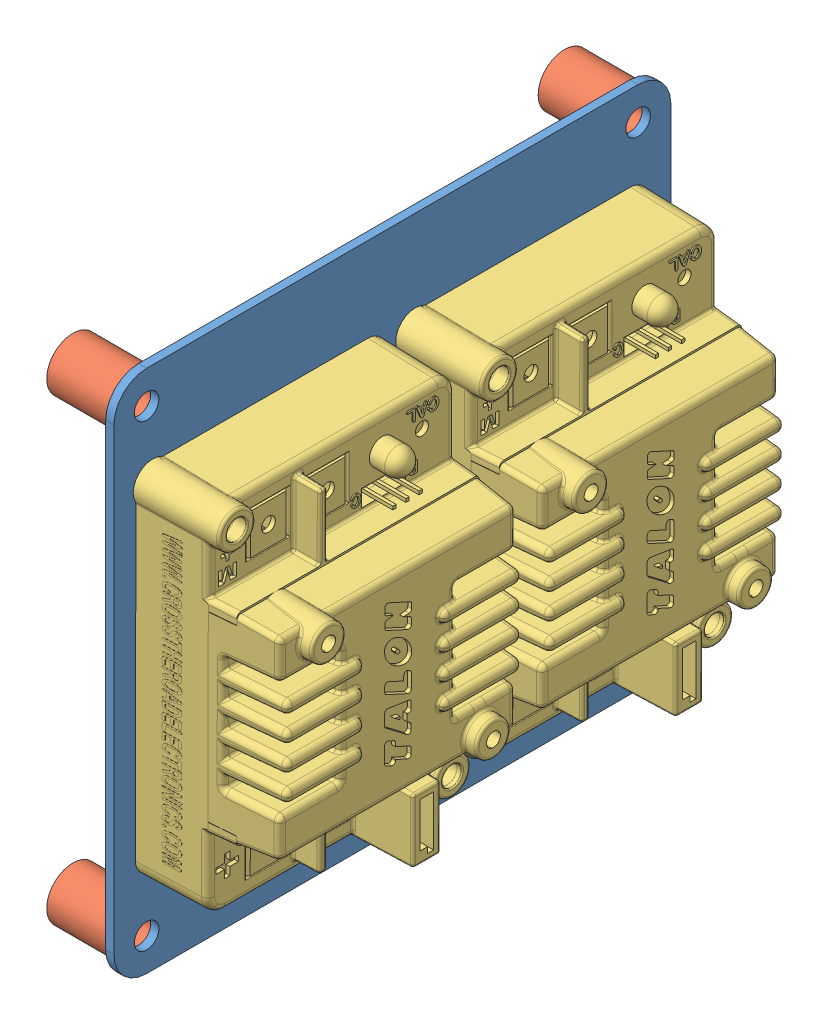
SolidWorks assembly 4 Talons with Mount.SLDASM, configuration Default (file format 8000). Lengths in mm.
Overall size (43.48 102.72 109.07).
7 component instances, 3 part files, 13 mates.
Components (placement in the parent):
- Talon Mount-1: Talon Mount.SLDPRT [Default] at (-21.0975 -1.6824 11.857) size (1.59 101.6 107.95)
- Board Standoff-1: Board Standoff.SLDPRT [Default] at (-33.7975 42.7676 -35.768) x (0 0.487532 -0.873105) z (0 -0.873105 -0.487532) size (10.16 12.7 10.16)
- Board Standoff-2: Board Standoff.SLDPRT [Default] at (-33.7975 42.7676 59.482) x (0 -0.175001 -0.984568) z (0 -0.984568 0.175001) size (10.16 12.7 10.16)
- Board Standoff-3: Board Standoff.SLDPRT [Default] at (-33.7975 -46.1324 -35.768) x (0 0.487532 -0.873105) z (0 -0.873105 -0.487532) size (10.16 12.7 10.16)
- Board Standoff-4: Board Standoff.SLDPRT [Default] at (-33.7975 -46.1324 59.482) x (0 0.487532 -0.873105) z (0 -0.873105 -0.487532) size (10.16 12.7 10.16)
- Talon-1: Talon.SLDPRT [Default] at (18.4352 -63.8285 -16.8463) x (0 -0.999999 0.0015) z (0 0.0015 0.999999) size (69.75 29.27 49.43)
- Talon-2: Talon.SLDPRT [Default] at (18.4352 -63.9048 -67.7224) x (0 -0.999999 0.0015) z (0 0.0015 0.999999) size (69.75 29.27 49.43)
Mates (geometry in assembly coordinates):
- Coincident1: coincident anti-aligned: plane of Talon Mount-1 through (-21.0975 -1.6824 11.857) normal (-1 0 0); plane of Board Standoff-1 through (-21.0975 42.7676 -35.768) normal (1 0 0)
- Concentric1: concentric aligned: cylinder of Talon Mount-1 through (-19.51 42.7676 -35.768) axis (-1 0 0) radius 2.3813; cylinder of Board Standoff-1 through (-21.0975 42.7676 -35.768) axis (-1 0 0) radius 2.3813
- Concentric2: concentric aligned: cylinder of Talon Mount-1 through (-19.51 42.7676 59.482) axis (-1 0 0) radius 2.3813; cylinder of Board Standoff-2 through (-21.0975 42.7676 59.482) axis (-1 0 0) radius 2.3813
- Coincident2: coincident anti-aligned: plane of Talon Mount-1 through (-21.0975 -1.6824 11.857) normal (-1 0 0); plane of Board Standoff-2 through (-21.0975 42.7676 59.482) normal (1 0 0)
- Concentric3: concentric aligned: cylinder of Talon Mount-1 through (-19.51 -46.1324 -35.768) axis (-1 0 0) radius 2.3813; cylinder of Board Standoff-3 through (-21.0975 -46.1324 -35.768) axis (-1 0 0) radius 2.3813
- Coincident3: coincident anti-aligned: plane of Talon Mount-1 through (-21.0975 -1.6824 11.857) normal (-1 0 0); plane of Board Standoff-3 through (-21.0975 -46.1324 -35.768) normal (1 0 0)
- Concentric4: concentric aligned: cylinder of Talon Mount-1 through (-19.51 -46.1324 59.482) axis (-1 0 0) radius 2.3813; cylinder of Board Standoff-4 through (-21.0975 -46.1324 59.482) axis (-1 0 0) radius 2.3813
- Coincident4: coincident anti-aligned: plane of Talon Mount-1 through (-21.0975 -1.6824 11.857) normal (-1 0 0); plane of Board Standoff-4 through (-21.0975 -46.1324 59.482) normal (1 0 0)
- Coincident5: coincident anti-aligned: plane of Talon Mount-1 through (-19.51 -1.6824 11.857) normal (1 0 0); plane of Talon-1 through (-19.51 29.5089 58.2881) normal (-1 0 0)
- Coincident6: coincident anti-aligned: plane of Talon Mount-1 through (-19.51 -1.6824 11.857) normal (1 0 0); plane of Talon-2 through (-19.51 29.4326 7.412) normal (-1 0 0)
- Coincident7: coincident aligned: plane of Talon-1 through (-19.51 -35.9558 18.5221) normal (0.017452 -0.999847 0.0015); plane of Talon-2 through (-19.51 -36.0321 -32.354) normal (0.017452 -0.999847 0.0015)
- Concentric5: concentric aligned: cylinder of Talon Mount-1 through (-21.0975 29.4326 7.412) axis (1 0 0) radius 2.3813; cylinder of Talon-2 through (-22.05 29.4326 7.412) axis (1 0 0) radius 1.905
- Concentric6: concentric anti-aligned: cylinder of Talon Mount-1 through (-21.0975 29.4326 58.212) axis (1 0 0) radius 2.3813; cylinder of Talon-1 through (-17.224 29.4326 58.212) axis (-1 0 0) radius 1.905
